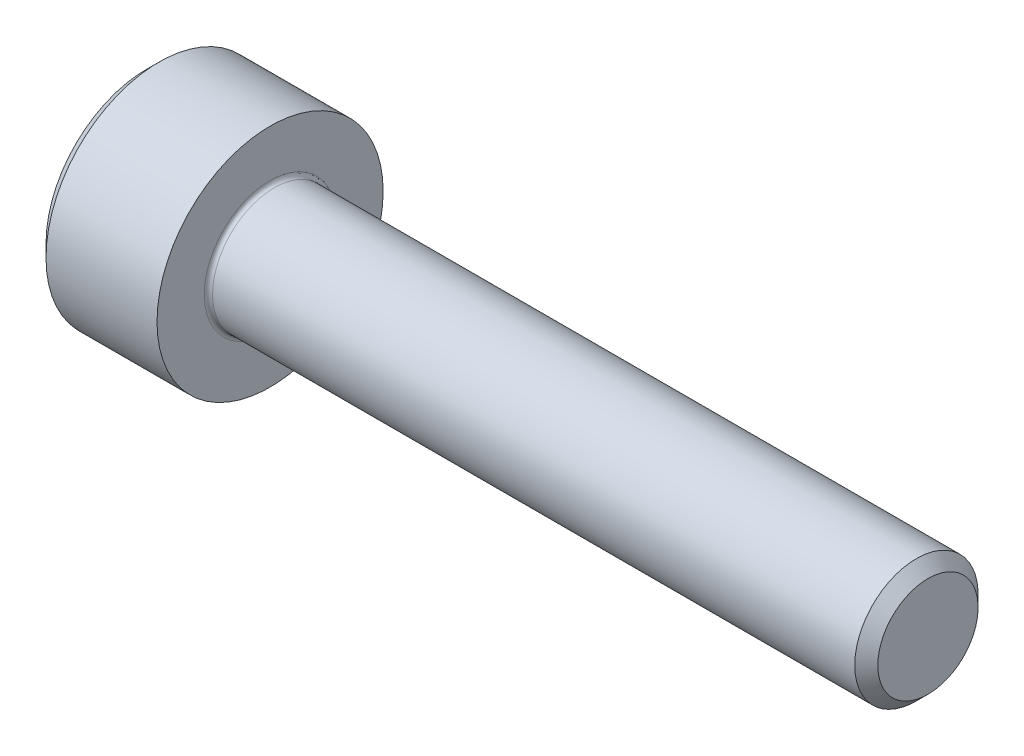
from build123d import *

# Parameters (mm, degrees)
FILLET1_R   = 0.1
HEX_2_DEPTH = 1.3


with BuildPart() as part:
    # BodySke → Base-Revolve (revolve)
    with BuildSketch(Plane.XY, mode=Mode.PRIVATE) as base_revolve_sk:
        Polygon((0, 0), (0, 2.45), (0.3, 2.75), (3, 2.75), (3, 1.5), (18.7195, 1.5), (19, 1.2195), (19, 0), align=None)
    revolve(base_revolve_sk.sketch.rotate(Axis((-31.75, 0, 0), (1, 0, 0)), 90), axis=Axis((-31.75, 0, 0), (1, 0, 0)))

    # Fillet1
    fillet1_edges = [part.edges().sort_by_distance(p)[0] for p in [
        (3, 0, -1.5),
    ]]
    fillet(fillet1_edges, radius=FILLET1_R)

    # Sketch2 → Hex-PreBroach (revolve, cut)
    with BuildSketch(Plane.XY, mode=Mode.PRIVATE) as hex_prebroach_sk:
        Polygon((0, 1.28), (1.3, 1.28), (2.039008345, 0), (0, 0), align=None)
    revolve(hex_prebroach_sk.sketch.rotate(Axis((0, 0, 0), (1, 0, 0)), 90), axis=Axis((0, 0, 0), (1, 0, 0)), mode=Mode.SUBTRACT)

    # Sketch3 → Hex 2 (cut)
    with BuildSketch(Plane(origin=(0, 0, 0), x_dir=(0, 0.500000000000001, 0.866025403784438), z_dir=(-1, 0, 0))):
        Polygon((0.739008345, 1.28), (-0.739008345, 1.28), (-1.478016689, 0), (-0.739008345, -1.28), (0.739008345, -1.28), (1.478016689, 0), align=None)
    extrude(amount=-HEX_2_DEPTH, mode=Mode.SUBTRACT)


solid = part.part
